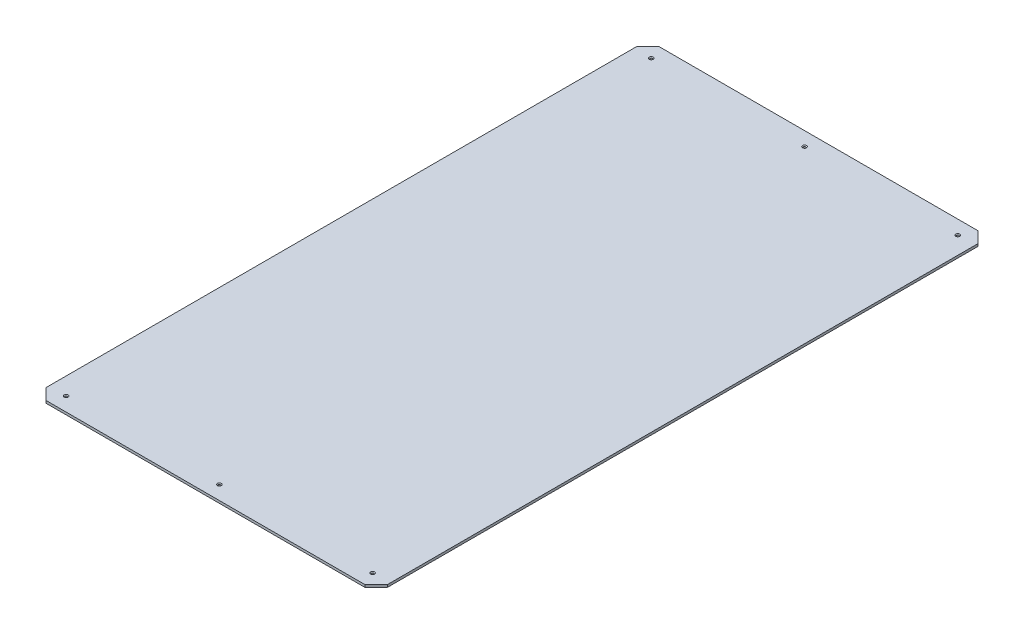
ISO-10303-21;
HEADER;
FILE_DESCRIPTION(('STEP AP214'),'2;1');
FILE_NAME('part.step','',(''),(''),'','','');
FILE_SCHEMA(('AUTOMOTIVE_DESIGN { 1 0 10303 214 1 1 1 1 }'));
ENDSEC;
DATA;
#1=APPLICATION_CONTEXT('core data for automotive mechanical design processes');
#2=APPLICATION_PROTOCOL_DEFINITION('international standard','automotive_design',2000,#1);
#3=PRODUCT_CONTEXT('',#1,'mechanical');
#4=PRODUCT('Part','Part','',(#3));
#5=PRODUCT_RELATED_PRODUCT_CATEGORY('part','',(#4));
#6=PRODUCT_DEFINITION_FORMATION('','',#4);
#7=PRODUCT_DEFINITION_CONTEXT('part definition',#1,'design');
#8=PRODUCT_DEFINITION('design','',#6,#7);
#9=PRODUCT_DEFINITION_SHAPE('','',#8);
#10=(LENGTH_UNIT() NAMED_UNIT(*) SI_UNIT(.MILLI.,.METRE.));
#11=(NAMED_UNIT(*) PLANE_ANGLE_UNIT() SI_UNIT($,.RADIAN.));
#12=(NAMED_UNIT(*) SI_UNIT($,.STERADIAN.) SOLID_ANGLE_UNIT());
#13=UNCERTAINTY_MEASURE_WITH_UNIT(LENGTH_MEASURE(1.E-05),#10,'distance_accuracy_value','');
#14=(GEOMETRIC_REPRESENTATION_CONTEXT(3) GLOBAL_UNCERTAINTY_ASSIGNED_CONTEXT((#13)) GLOBAL_UNIT_ASSIGNED_CONTEXT((#10,
#11,#12)) REPRESENTATION_CONTEXT('',''));
#15=CARTESIAN_POINT('',(0.,0.,0.));
#16=DIRECTION('',(0.,0.,1.));
#17=DIRECTION('',(1.,0.,0.));
#18=AXIS2_PLACEMENT_3D('',#15,#16,#17);
#19=CARTESIAN_POINT('',(-245.,-3.5,440.));
#20=DIRECTION('',(-1.,0.,0.));
#21=DIRECTION('',(0.,0.,1.));
#22=AXIS2_PLACEMENT_3D('',#19,#20,#21);
#23=PLANE('',#22);
#24=DIRECTION('',(0.,0.,1.));
#25=VECTOR('',#24,1.);
#26=CARTESIAN_POINT('',(-245.,0.,440.));
#27=LINE('',#26,#25);
#28=CARTESIAN_POINT('',(-245.,0.,-424.));
#29=VERTEX_POINT('',#28);
#30=CARTESIAN_POINT('',(-245.,0.,424.));
#31=VERTEX_POINT('',#30);
#32=EDGE_CURVE('E97',#29,#31,#27,.T.);
#33=ORIENTED_EDGE('',*,*,#32,.F.);
#34=DIRECTION('',(0.,-1.,0.));
#35=VECTOR('',#34,1.);
#36=CARTESIAN_POINT('',(-245.,-3.5,-424.));
#37=LINE('',#36,#35);
#38=CARTESIAN_POINT('',(-245.,-3.5,-424.));
#39=VERTEX_POINT('',#38);
#40=EDGE_CURVE('E146',#29,#39,#37,.T.);
#41=ORIENTED_EDGE('',*,*,#40,.T.);
#42=DIRECTION('',(0.,0.,1.));
#43=VECTOR('',#42,1.);
#44=CARTESIAN_POINT('',(-245.,-3.5,440.));
#45=LINE('',#44,#43);
#46=CARTESIAN_POINT('',(-245.,-3.5,424.));
#47=VERTEX_POINT('',#46);
#48=EDGE_CURVE('E120',#39,#47,#45,.T.);
#49=ORIENTED_EDGE('',*,*,#48,.T.);
#50=DIRECTION('',(0.,1.,0.));
#51=VECTOR('',#50,1.);
#52=CARTESIAN_POINT('',(-245.,-3.5,424.));
#53=LINE('',#52,#51);
#54=EDGE_CURVE('E116',#47,#31,#53,.T.);
#55=ORIENTED_EDGE('',*,*,#54,.T.);
#56=EDGE_LOOP('',(#33,#41,#49,#55));
#57=FACE_BOUND('',#56,.T.);
#58=ADVANCED_FACE('F36',(#57),#23,.T.);
#59=CARTESIAN_POINT('',(245.,-3.5,-440.));
#60=DIRECTION('',(0.,0.,-1.));
#61=DIRECTION('',(-1.,0.,0.));
#62=AXIS2_PLACEMENT_3D('',#59,#60,#61);
#63=PLANE('',#62);
#64=DIRECTION('',(-1.,0.,0.));
#65=VECTOR('',#64,1.);
#66=CARTESIAN_POINT('',(245.,0.,-440.));
#67=LINE('',#66,#65);
#68=CARTESIAN_POINT('',(229.,0.,-440.));
#69=VERTEX_POINT('',#68);
#70=CARTESIAN_POINT('',(-229.,0.,-440.));
#71=VERTEX_POINT('',#70);
#72=EDGE_CURVE('E127',#69,#71,#67,.T.);
#73=ORIENTED_EDGE('',*,*,#72,.F.);
#74=DIRECTION('',(0.,-1.,0.));
#75=VECTOR('',#74,1.);
#76=CARTESIAN_POINT('',(229.,-3.5,-440.));
#77=LINE('',#76,#75);
#78=CARTESIAN_POINT('',(229.,-3.5,-440.));
#79=VERTEX_POINT('',#78);
#80=EDGE_CURVE('E44',#69,#79,#77,.T.);
#81=ORIENTED_EDGE('',*,*,#80,.T.);
#82=DIRECTION('',(-1.,0.,0.));
#83=VECTOR('',#82,1.);
#84=CARTESIAN_POINT('',(245.,-3.5,-440.));
#85=LINE('',#84,#83);
#86=CARTESIAN_POINT('',(-229.,-3.5,-440.));
#87=VERTEX_POINT('',#86);
#88=EDGE_CURVE('E122',#79,#87,#85,.T.);
#89=ORIENTED_EDGE('',*,*,#88,.T.);
#90=DIRECTION('',(0.,1.,0.));
#91=VECTOR('',#90,1.);
#92=CARTESIAN_POINT('',(-229.,-3.5,-440.));
#93=LINE('',#92,#91);
#94=EDGE_CURVE('E142',#87,#71,#93,.T.);
#95=ORIENTED_EDGE('',*,*,#94,.T.);
#96=EDGE_LOOP('',(#73,#81,#89,#95));
#97=FACE_BOUND('',#96,.T.);
#98=ADVANCED_FACE('F258',(#97),#63,.T.);
#99=CARTESIAN_POINT('',(245.,-3.5,440.));
#100=DIRECTION('',(1.,0.,0.));
#101=DIRECTION('',(0.,0.,-1.));
#102=AXIS2_PLACEMENT_3D('',#99,#100,#101);
#103=PLANE('',#102);
#104=DIRECTION('',(0.,0.,-1.));
#105=VECTOR('',#104,1.);
#106=CARTESIAN_POINT('',(245.,-3.5,440.));
#107=LINE('',#106,#105);
#108=CARTESIAN_POINT('',(245.,-3.5,424.));
#109=VERTEX_POINT('',#108);
#110=CARTESIAN_POINT('',(245.,-3.5,-424.));
#111=VERTEX_POINT('',#110);
#112=EDGE_CURVE('E124',#109,#111,#107,.T.);
#113=ORIENTED_EDGE('',*,*,#112,.T.);
#114=DIRECTION('',(0.,1.,0.));
#115=VECTOR('',#114,1.);
#116=CARTESIAN_POINT('',(245.,-3.5,-424.));
#117=LINE('',#116,#115);
#118=CARTESIAN_POINT('',(245.,0.,-424.));
#119=VERTEX_POINT('',#118);
#120=EDGE_CURVE('E151',#111,#119,#117,.T.);
#121=ORIENTED_EDGE('',*,*,#120,.T.);
#122=DIRECTION('',(0.,0.,-1.));
#123=VECTOR('',#122,1.);
#124=CARTESIAN_POINT('',(245.,0.,440.));
#125=LINE('',#124,#123);
#126=CARTESIAN_POINT('',(245.,0.,424.));
#127=VERTEX_POINT('',#126);
#128=EDGE_CURVE('E159',#127,#119,#125,.T.);
#129=ORIENTED_EDGE('',*,*,#128,.F.);
#130=DIRECTION('',(0.,-1.,0.));
#131=VECTOR('',#130,1.);
#132=CARTESIAN_POINT('',(245.,-3.5,424.));
#133=LINE('',#132,#131);
#134=EDGE_CURVE('E138',#127,#109,#133,.T.);
#135=ORIENTED_EDGE('',*,*,#134,.T.);
#136=EDGE_LOOP('',(#113,#121,#129,#135));
#137=FACE_BOUND('',#136,.T.);
#138=ADVANCED_FACE('F158',(#137),#103,.T.);
#139=CARTESIAN_POINT('',(245.,-3.5,440.));
#140=DIRECTION('',(0.,0.,1.));
#141=DIRECTION('',(1.,0.,0.));
#142=AXIS2_PLACEMENT_3D('',#139,#140,#141);
#143=PLANE('',#142);
#144=DIRECTION('',(1.,0.,0.));
#145=VECTOR('',#144,1.);
#146=CARTESIAN_POINT('',(245.,-3.5,440.));
#147=LINE('',#146,#145);
#148=CARTESIAN_POINT('',(-229.,-3.5,440.));
#149=VERTEX_POINT('',#148);
#150=CARTESIAN_POINT('',(229.,-3.5,440.));
#151=VERTEX_POINT('',#150);
#152=EDGE_CURVE('E167',#149,#151,#147,.T.);
#153=ORIENTED_EDGE('',*,*,#152,.T.);
#154=DIRECTION('',(0.,1.,0.));
#155=VECTOR('',#154,1.);
#156=CARTESIAN_POINT('',(229.,-3.5,440.));
#157=LINE('',#156,#155);
#158=CARTESIAN_POINT('',(229.,0.,440.));
#159=VERTEX_POINT('',#158);
#160=EDGE_CURVE('E133',#151,#159,#157,.T.);
#161=ORIENTED_EDGE('',*,*,#160,.T.);
#162=DIRECTION('',(1.,0.,0.));
#163=VECTOR('',#162,1.);
#164=CARTESIAN_POINT('',(245.,0.,440.));
#165=LINE('',#164,#163);
#166=CARTESIAN_POINT('',(-229.,0.,440.));
#167=VERTEX_POINT('',#166);
#168=EDGE_CURVE('E108',#167,#159,#165,.T.);
#169=ORIENTED_EDGE('',*,*,#168,.F.);
#170=DIRECTION('',(0.,-1.,0.));
#171=VECTOR('',#170,1.);
#172=CARTESIAN_POINT('',(-229.,-3.5,440.));
#173=LINE('',#172,#171);
#174=EDGE_CURVE('E117',#167,#149,#173,.T.);
#175=ORIENTED_EDGE('',*,*,#174,.T.);
#176=EDGE_LOOP('',(#153,#161,#169,#175));
#177=FACE_BOUND('',#176,.T.);
#178=ADVANCED_FACE('F266',(#177),#143,.T.);
#179=CARTESIAN_POINT('',(-245.,-3.5,-440.));
#180=DIRECTION('',(0.,1.,0.));
#181=DIRECTION('',(0.,0.,1.));
#182=AXIS2_PLACEMENT_3D('',#179,#180,#181);
#183=PLANE('',#182);
#184=CARTESIAN_POINT('',(-220.,-3.5,-420.));
#185=DIRECTION('',(0.,1.,0.));
#186=DIRECTION('',(0.,0.,1.));
#187=AXIS2_PLACEMENT_3D('',#184,#185,#186);
#188=CIRCLE('',#187,1.63194999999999);
#189=CARTESIAN_POINT('',(-220.,-3.5,-418.36805));
#190=VERTEX_POINT('',#189);
#191=EDGE_CURVE('E215',#190,#190,#188,.T.);
#192=ORIENTED_EDGE('',*,*,#191,.T.);
#193=EDGE_LOOP('',(#192));
#194=FACE_BOUND('',#193,.T.);
#195=CARTESIAN_POINT('',(0.,-3.5,-420.));
#196=DIRECTION('',(0.,1.,0.));
#197=DIRECTION('',(0.,0.,1.));
#198=AXIS2_PLACEMENT_3D('',#195,#196,#197);
#199=CIRCLE('',#198,1.63195);
#200=CARTESIAN_POINT('',(0.,-3.5,-418.36805));
#201=VERTEX_POINT('',#200);
#202=EDGE_CURVE('E206',#201,#201,#199,.T.);
#203=ORIENTED_EDGE('',*,*,#202,.T.);
#204=EDGE_LOOP('',(#203));
#205=FACE_BOUND('',#204,.T.);
#206=CARTESIAN_POINT('',(220.,-3.5,-420.));
#207=DIRECTION('',(0.,1.,0.));
#208=DIRECTION('',(0.,0.,1.));
#209=AXIS2_PLACEMENT_3D('',#206,#207,#208);
#210=CIRCLE('',#209,1.63194999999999);
#211=CARTESIAN_POINT('',(220.,-3.5,-418.36805));
#212=VERTEX_POINT('',#211);
#213=EDGE_CURVE('E197',#212,#212,#210,.T.);
#214=ORIENTED_EDGE('',*,*,#213,.T.);
#215=EDGE_LOOP('',(#214));
#216=FACE_BOUND('',#215,.T.);
#217=CARTESIAN_POINT('',(-220.,-3.5,420.));
#218=DIRECTION('',(0.,1.,0.));
#219=DIRECTION('',(0.,0.,1.));
#220=AXIS2_PLACEMENT_3D('',#217,#218,#219);
#221=CIRCLE('',#220,1.63194999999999);
#222=CARTESIAN_POINT('',(-220.,-3.5,421.63195));
#223=VERTEX_POINT('',#222);
#224=EDGE_CURVE('E188',#223,#223,#221,.T.);
#225=ORIENTED_EDGE('',*,*,#224,.T.);
#226=EDGE_LOOP('',(#225));
#227=FACE_BOUND('',#226,.T.);
#228=CARTESIAN_POINT('',(0.,-3.5,420.));
#229=DIRECTION('',(0.,1.,0.));
#230=DIRECTION('',(0.,0.,1.));
#231=AXIS2_PLACEMENT_3D('',#228,#229,#230);
#232=CIRCLE('',#231,1.63195);
#233=CARTESIAN_POINT('',(0.,-3.5,421.63195));
#234=VERTEX_POINT('',#233);
#235=EDGE_CURVE('E179',#234,#234,#232,.T.);
#236=ORIENTED_EDGE('',*,*,#235,.T.);
#237=EDGE_LOOP('',(#236));
#238=FACE_BOUND('',#237,.T.);
#239=CARTESIAN_POINT('',(220.,-3.5,420.));
#240=DIRECTION('',(0.,1.,0.));
#241=DIRECTION('',(0.,0.,1.));
#242=AXIS2_PLACEMENT_3D('',#239,#240,#241);
#243=CIRCLE('',#242,1.63194999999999);
#244=CARTESIAN_POINT('',(220.,-3.5,421.63195));
#245=VERTEX_POINT('',#244);
#246=EDGE_CURVE('E109',#245,#245,#243,.T.);
#247=ORIENTED_EDGE('',*,*,#246,.T.);
#248=EDGE_LOOP('',(#247));
#249=FACE_BOUND('',#248,.T.);
#250=ORIENTED_EDGE('',*,*,#88,.F.);
#251=DIRECTION('',(-0.707106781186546,0.,-0.707106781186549));
#252=VECTOR('',#251,1.);
#253=CARTESIAN_POINT('',(245.,-3.5,-424.));
#254=LINE('',#253,#252);
#255=EDGE_CURVE('E11',#79,#111,#254,.F.);
#256=ORIENTED_EDGE('',*,*,#255,.T.);
#257=ORIENTED_EDGE('',*,*,#112,.F.);
#258=DIRECTION('',(0.707106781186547,0.,-0.707106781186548));
#259=VECTOR('',#258,1.);
#260=CARTESIAN_POINT('',(229.,-3.5,440.));
#261=LINE('',#260,#259);
#262=EDGE_CURVE('E140',#109,#151,#261,.F.);
#263=ORIENTED_EDGE('',*,*,#262,.T.);
#264=ORIENTED_EDGE('',*,*,#152,.F.);
#265=DIRECTION('',(0.707106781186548,0.,0.707106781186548));
#266=VECTOR('',#265,1.);
#267=CARTESIAN_POINT('',(-245.,-3.5,424.));
#268=LINE('',#267,#266);
#269=EDGE_CURVE('E131',#149,#47,#268,.F.);
#270=ORIENTED_EDGE('',*,*,#269,.T.);
#271=ORIENTED_EDGE('',*,*,#48,.F.);
#272=DIRECTION('',(-0.70710678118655,0.,0.707106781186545));
#273=VECTOR('',#272,1.);
#274=CARTESIAN_POINT('',(-229.,-3.5,-440.));
#275=LINE('',#274,#273);
#276=EDGE_CURVE('E148',#39,#87,#275,.F.);
#277=ORIENTED_EDGE('',*,*,#276,.T.);
#278=EDGE_LOOP('',(#250,#256,#257,#263,#264,#270,#271,#277));
#279=FACE_BOUND('',#278,.T.);
#280=ADVANCED_FACE('F229',(#194,#205,#216,#227,#238,#249,#279),#183,.F.);
#281=CARTESIAN_POINT('',(-245.,0.,-440.));
#282=DIRECTION('',(0.,1.,0.));
#283=DIRECTION('',(0.,0.,1.));
#284=AXIS2_PLACEMENT_3D('',#281,#282,#283);
#285=PLANE('',#284);
#286=CARTESIAN_POINT('',(-220.,0.,-420.));
#287=DIRECTION('',(0.,1.,0.));
#288=DIRECTION('',(0.,0.,1.));
#289=AXIS2_PLACEMENT_3D('',#286,#287,#288);
#290=CIRCLE('',#289,2.85750000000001);
#291=CARTESIAN_POINT('',(-220.,0.,-417.1425));
#292=VERTEX_POINT('',#291);
#293=EDGE_CURVE('E221',#292,#292,#290,.T.);
#294=ORIENTED_EDGE('',*,*,#293,.F.);
#295=EDGE_LOOP('',(#294));
#296=FACE_BOUND('',#295,.T.);
#297=CARTESIAN_POINT('',(0.,0.,-420.));
#298=DIRECTION('',(0.,1.,0.));
#299=DIRECTION('',(0.,0.,1.));
#300=AXIS2_PLACEMENT_3D('',#297,#298,#299);
#301=CIRCLE('',#300,2.8575);
#302=CARTESIAN_POINT('',(0.,0.,-417.1425));
#303=VERTEX_POINT('',#302);
#304=EDGE_CURVE('E212',#303,#303,#301,.T.);
#305=ORIENTED_EDGE('',*,*,#304,.F.);
#306=EDGE_LOOP('',(#305));
#307=FACE_BOUND('',#306,.T.);
#308=CARTESIAN_POINT('',(220.,0.,-420.));
#309=DIRECTION('',(0.,1.,0.));
#310=DIRECTION('',(0.,0.,1.));
#311=AXIS2_PLACEMENT_3D('',#308,#309,#310);
#312=CIRCLE('',#311,2.85750000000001);
#313=CARTESIAN_POINT('',(220.,0.,-417.1425));
#314=VERTEX_POINT('',#313);
#315=EDGE_CURVE('E203',#314,#314,#312,.T.);
#316=ORIENTED_EDGE('',*,*,#315,.F.);
#317=EDGE_LOOP('',(#316));
#318=FACE_BOUND('',#317,.T.);
#319=CARTESIAN_POINT('',(-220.,0.,420.));
#320=DIRECTION('',(0.,1.,0.));
#321=DIRECTION('',(0.,0.,1.));
#322=AXIS2_PLACEMENT_3D('',#319,#320,#321);
#323=CIRCLE('',#322,2.85750000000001);
#324=CARTESIAN_POINT('',(-220.,0.,422.8575));
#325=VERTEX_POINT('',#324);
#326=EDGE_CURVE('E194',#325,#325,#323,.T.);
#327=ORIENTED_EDGE('',*,*,#326,.F.);
#328=EDGE_LOOP('',(#327));
#329=FACE_BOUND('',#328,.T.);
#330=CARTESIAN_POINT('',(0.,0.,420.));
#331=DIRECTION('',(0.,1.,0.));
#332=DIRECTION('',(0.,0.,1.));
#333=AXIS2_PLACEMENT_3D('',#330,#331,#332);
#334=CIRCLE('',#333,2.8575);
#335=CARTESIAN_POINT('',(0.,0.,422.8575));
#336=VERTEX_POINT('',#335);
#337=EDGE_CURVE('E185',#336,#336,#334,.T.);
#338=ORIENTED_EDGE('',*,*,#337,.F.);
#339=EDGE_LOOP('',(#338));
#340=FACE_BOUND('',#339,.T.);
#341=CARTESIAN_POINT('',(220.,0.,420.));
#342=DIRECTION('',(0.,1.,0.));
#343=DIRECTION('',(0.,0.,1.));
#344=AXIS2_PLACEMENT_3D('',#341,#342,#343);
#345=CIRCLE('',#344,2.85750000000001);
#346=CARTESIAN_POINT('',(220.,0.,422.8575));
#347=VERTEX_POINT('',#346);
#348=EDGE_CURVE('E176',#347,#347,#345,.T.);
#349=ORIENTED_EDGE('',*,*,#348,.F.);
#350=EDGE_LOOP('',(#349));
#351=FACE_BOUND('',#350,.T.);
#352=ORIENTED_EDGE('',*,*,#128,.T.);
#353=DIRECTION('',(0.707106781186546,0.,0.707106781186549));
#354=VECTOR('',#353,1.);
#355=CARTESIAN_POINT('',(-7.99999999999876,0.,-677.));
#356=LINE('',#355,#354);
#357=EDGE_CURVE('E58',#119,#69,#356,.F.);
#358=ORIENTED_EDGE('',*,*,#357,.T.);
#359=ORIENTED_EDGE('',*,*,#72,.T.);
#360=DIRECTION('',(0.70710678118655,0.,-0.707106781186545));
#361=VECTOR('',#360,1.);
#362=CARTESIAN_POINT('',(-237.,0.,-432.));
#363=LINE('',#362,#361);
#364=EDGE_CURVE('E104',#71,#29,#363,.F.);
#365=ORIENTED_EDGE('',*,*,#364,.T.);
#366=ORIENTED_EDGE('',*,*,#32,.T.);
#367=DIRECTION('',(-0.707106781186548,0.,-0.707106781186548));
#368=VECTOR('',#367,1.);
#369=CARTESIAN_POINT('',(-677.,0.,-7.99999999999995));
#370=LINE('',#369,#368);
#371=EDGE_CURVE('E101',#31,#167,#370,.F.);
#372=ORIENTED_EDGE('',*,*,#371,.T.);
#373=ORIENTED_EDGE('',*,*,#168,.T.);
#374=DIRECTION('',(-0.707106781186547,0.,0.707106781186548));
#375=VECTOR('',#374,1.);
#376=CARTESIAN_POINT('',(432.,0.,236.999999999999));
#377=LINE('',#376,#375);
#378=EDGE_CURVE('E136',#159,#127,#377,.F.);
#379=ORIENTED_EDGE('',*,*,#378,.T.);
#380=EDGE_LOOP('',(#352,#358,#359,#365,#366,#372,#373,#379));
#381=FACE_BOUND('',#380,.T.);
#382=ADVANCED_FACE('F99',(#296,#307,#318,#329,#340,#351,#381),#285,.T.);
#383=CARTESIAN_POINT('',(-245.,-3.5,424.));
#384=DIRECTION('',(0.707106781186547,0.,-0.707106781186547));
#385=DIRECTION('',(-0.707106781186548,0.,-0.707106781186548));
#386=AXIS2_PLACEMENT_3D('',#383,#384,#385);
#387=PLANE('',#386);
#388=ORIENTED_EDGE('',*,*,#269,.F.);
#389=ORIENTED_EDGE('',*,*,#174,.F.);
#390=ORIENTED_EDGE('',*,*,#371,.F.);
#391=ORIENTED_EDGE('',*,*,#54,.F.);
#392=EDGE_LOOP('',(#388,#389,#390,#391));
#393=FACE_BOUND('',#392,.T.);
#394=ADVANCED_FACE('F115',(#393),#387,.F.);
#395=CARTESIAN_POINT('',(229.,-3.5,440.));
#396=DIRECTION('',(-0.707106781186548,0.,-0.707106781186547));
#397=DIRECTION('',(-0.707106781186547,0.,0.707106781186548));
#398=AXIS2_PLACEMENT_3D('',#395,#396,#397);
#399=PLANE('',#398);
#400=ORIENTED_EDGE('',*,*,#262,.F.);
#401=ORIENTED_EDGE('',*,*,#134,.F.);
#402=ORIENTED_EDGE('',*,*,#378,.F.);
#403=ORIENTED_EDGE('',*,*,#160,.F.);
#404=EDGE_LOOP('',(#400,#401,#402,#403));
#405=FACE_BOUND('',#404,.T.);
#406=ADVANCED_FACE('F270',(#405),#399,.F.);
#407=CARTESIAN_POINT('',(-229.,-3.5,-440.));
#408=DIRECTION('',(0.707106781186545,0.,0.70710678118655));
#409=DIRECTION('',(0.70710678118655,0.,-0.707106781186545));
#410=AXIS2_PLACEMENT_3D('',#407,#408,#409);
#411=PLANE('',#410);
#412=ORIENTED_EDGE('',*,*,#276,.F.);
#413=ORIENTED_EDGE('',*,*,#40,.F.);
#414=ORIENTED_EDGE('',*,*,#364,.F.);
#415=ORIENTED_EDGE('',*,*,#94,.F.);
#416=EDGE_LOOP('',(#412,#413,#414,#415));
#417=FACE_BOUND('',#416,.T.);
#418=ADVANCED_FACE('F272',(#417),#411,.F.);
#419=CARTESIAN_POINT('',(245.,-3.5,-424.));
#420=DIRECTION('',(-0.707106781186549,0.,0.707106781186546));
#421=DIRECTION('',(0.707106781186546,0.,0.707106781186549));
#422=AXIS2_PLACEMENT_3D('',#419,#420,#421);
#423=PLANE('',#422);
#424=ORIENTED_EDGE('',*,*,#255,.F.);
#425=ORIENTED_EDGE('',*,*,#80,.F.);
#426=ORIENTED_EDGE('',*,*,#357,.F.);
#427=ORIENTED_EDGE('',*,*,#120,.F.);
#428=EDGE_LOOP('',(#424,#425,#426,#427));
#429=FACE_BOUND('',#428,.T.);
#430=ADVANCED_FACE('F38',(#429),#423,.F.);
#431=CARTESIAN_POINT('',(220.,0.,420.));
#432=DIRECTION('',(0.,1.,0.));
#433=DIRECTION('',(0.,0.,1.));
#434=AXIS2_PLACEMENT_3D('',#431,#432,#433);
#435=CYLINDRICAL_SURFACE('',#434,1.63194999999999);
#436=ORIENTED_EDGE('',*,*,#246,.F.);
#437=EDGE_LOOP('',(#436));
#438=FACE_BOUND('',#437,.T.);
#439=CARTESIAN_POINT('',(220.,-1.02835855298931,420.));
#440=DIRECTION('',(0.,1.,0.));
#441=DIRECTION('',(0.,0.,1.));
#442=AXIS2_PLACEMENT_3D('',#439,#440,#441);
#443=CIRCLE('',#442,1.63194999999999);
#444=CARTESIAN_POINT('',(220.,-1.02835855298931,421.63195));
#445=VERTEX_POINT('',#444);
#446=EDGE_CURVE('E173',#445,#445,#443,.T.);
#447=ORIENTED_EDGE('',*,*,#446,.T.);
#448=EDGE_LOOP('',(#447));
#449=FACE_BOUND('',#448,.T.);
#450=ADVANCED_FACE('F244',(#438,#449),#435,.F.);
#451=CARTESIAN_POINT('',(220.,0.,420.));
#452=DIRECTION('',(0.,1.,0.));
#453=DIRECTION('',(0.,0.,1.));
#454=AXIS2_PLACEMENT_3D('',#451,#452,#453);
#455=CONICAL_SURFACE('',#454,2.85750000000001,0.872664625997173);
#456=ORIENTED_EDGE('',*,*,#446,.F.);
#457=EDGE_LOOP('',(#456));
#458=FACE_BOUND('',#457,.T.);
#459=ORIENTED_EDGE('',*,*,#348,.T.);
#460=EDGE_LOOP('',(#459));
#461=FACE_BOUND('',#460,.T.);
#462=ADVANCED_FACE('F241',(#458,#461),#455,.F.);
#463=CARTESIAN_POINT('',(0.,0.,420.));
#464=DIRECTION('',(0.,1.,0.));
#465=DIRECTION('',(0.,0.,1.));
#466=AXIS2_PLACEMENT_3D('',#463,#464,#465);
#467=CYLINDRICAL_SURFACE('',#466,1.63195);
#468=ORIENTED_EDGE('',*,*,#235,.F.);
#469=EDGE_LOOP('',(#468));
#470=FACE_BOUND('',#469,.T.);
#471=CARTESIAN_POINT('',(0.,-1.02835855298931,420.));
#472=DIRECTION('',(0.,1.,0.));
#473=DIRECTION('',(0.,0.,1.));
#474=AXIS2_PLACEMENT_3D('',#471,#472,#473);
#475=CIRCLE('',#474,1.63195);
#476=CARTESIAN_POINT('',(0.,-1.02835855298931,421.63195));
#477=VERTEX_POINT('',#476);
#478=EDGE_CURVE('E182',#477,#477,#475,.T.);
#479=ORIENTED_EDGE('',*,*,#478,.T.);
#480=EDGE_LOOP('',(#479));
#481=FACE_BOUND('',#480,.T.);
#482=ADVANCED_FACE('F243',(#470,#481),#467,.F.);
#483=CARTESIAN_POINT('',(0.,0.,420.));
#484=DIRECTION('',(0.,1.,0.));
#485=DIRECTION('',(0.,0.,1.));
#486=AXIS2_PLACEMENT_3D('',#483,#484,#485);
#487=CONICAL_SURFACE('',#486,2.8575,0.872664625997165);
#488=ORIENTED_EDGE('',*,*,#478,.F.);
#489=EDGE_LOOP('',(#488));
#490=FACE_BOUND('',#489,.T.);
#491=ORIENTED_EDGE('',*,*,#337,.T.);
#492=EDGE_LOOP('',(#491));
#493=FACE_BOUND('',#492,.T.);
#494=ADVANCED_FACE('F251',(#490,#493),#487,.F.);
#495=CARTESIAN_POINT('',(-220.,0.,420.));
#496=DIRECTION('',(0.,1.,0.));
#497=DIRECTION('',(0.,0.,1.));
#498=AXIS2_PLACEMENT_3D('',#495,#496,#497);
#499=CYLINDRICAL_SURFACE('',#498,1.63194999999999);
#500=ORIENTED_EDGE('',*,*,#224,.F.);
#501=EDGE_LOOP('',(#500));
#502=FACE_BOUND('',#501,.T.);
#503=CARTESIAN_POINT('',(-220.,-1.02835855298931,420.));
#504=DIRECTION('',(0.,1.,0.));
#505=DIRECTION('',(0.,0.,1.));
#506=AXIS2_PLACEMENT_3D('',#503,#504,#505);
#507=CIRCLE('',#506,1.63194999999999);
#508=CARTESIAN_POINT('',(-220.,-1.02835855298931,421.63195));
#509=VERTEX_POINT('',#508);
#510=EDGE_CURVE('E191',#509,#509,#507,.T.);
#511=ORIENTED_EDGE('',*,*,#510,.T.);
#512=EDGE_LOOP('',(#511));
#513=FACE_BOUND('',#512,.T.);
#514=ADVANCED_FACE('F376',(#502,#513),#499,.F.);
#515=CARTESIAN_POINT('',(-220.,0.,420.));
#516=DIRECTION('',(0.,1.,0.));
#517=DIRECTION('',(0.,0.,1.));
#518=AXIS2_PLACEMENT_3D('',#515,#516,#517);
#519=CONICAL_SURFACE('',#518,2.85750000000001,0.872664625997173);
#520=ORIENTED_EDGE('',*,*,#510,.F.);
#521=EDGE_LOOP('',(#520));
#522=FACE_BOUND('',#521,.T.);
#523=ORIENTED_EDGE('',*,*,#326,.T.);
#524=EDGE_LOOP('',(#523));
#525=FACE_BOUND('',#524,.T.);
#526=ADVANCED_FACE('F385',(#522,#525),#519,.F.);
#527=CARTESIAN_POINT('',(220.,0.,-420.));
#528=DIRECTION('',(0.,1.,0.));
#529=DIRECTION('',(0.,0.,1.));
#530=AXIS2_PLACEMENT_3D('',#527,#528,#529);
#531=CYLINDRICAL_SURFACE('',#530,1.63194999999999);
#532=ORIENTED_EDGE('',*,*,#213,.F.);
#533=EDGE_LOOP('',(#532));
#534=FACE_BOUND('',#533,.T.);
#535=CARTESIAN_POINT('',(220.,-1.02835855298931,-420.));
#536=DIRECTION('',(0.,1.,0.));
#537=DIRECTION('',(0.,0.,1.));
#538=AXIS2_PLACEMENT_3D('',#535,#536,#537);
#539=CIRCLE('',#538,1.63194999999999);
#540=CARTESIAN_POINT('',(220.,-1.02835855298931,-418.36805));
#541=VERTEX_POINT('',#540);
#542=EDGE_CURVE('E200',#541,#541,#539,.T.);
#543=ORIENTED_EDGE('',*,*,#542,.T.);
#544=EDGE_LOOP('',(#543));
#545=FACE_BOUND('',#544,.T.);
#546=ADVANCED_FACE('F394',(#534,#545),#531,.F.);
#547=CARTESIAN_POINT('',(220.,0.,-420.));
#548=DIRECTION('',(0.,1.,0.));
#549=DIRECTION('',(0.,0.,1.));
#550=AXIS2_PLACEMENT_3D('',#547,#548,#549);
#551=CONICAL_SURFACE('',#550,2.85750000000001,0.872664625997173);
#552=ORIENTED_EDGE('',*,*,#542,.F.);
#553=EDGE_LOOP('',(#552));
#554=FACE_BOUND('',#553,.T.);
#555=ORIENTED_EDGE('',*,*,#315,.T.);
#556=EDGE_LOOP('',(#555));
#557=FACE_BOUND('',#556,.T.);
#558=ADVANCED_FACE('F403',(#554,#557),#551,.F.);
#559=CARTESIAN_POINT('',(0.,0.,-420.));
#560=DIRECTION('',(0.,1.,0.));
#561=DIRECTION('',(0.,0.,1.));
#562=AXIS2_PLACEMENT_3D('',#559,#560,#561);
#563=CYLINDRICAL_SURFACE('',#562,1.63195);
#564=ORIENTED_EDGE('',*,*,#202,.F.);
#565=EDGE_LOOP('',(#564));
#566=FACE_BOUND('',#565,.T.);
#567=CARTESIAN_POINT('',(0.,-1.02835855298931,-420.));
#568=DIRECTION('',(0.,1.,0.));
#569=DIRECTION('',(0.,0.,1.));
#570=AXIS2_PLACEMENT_3D('',#567,#568,#569);
#571=CIRCLE('',#570,1.63195);
#572=CARTESIAN_POINT('',(0.,-1.02835855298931,-418.36805));
#573=VERTEX_POINT('',#572);
#574=EDGE_CURVE('E209',#573,#573,#571,.T.);
#575=ORIENTED_EDGE('',*,*,#574,.T.);
#576=EDGE_LOOP('',(#575));
#577=FACE_BOUND('',#576,.T.);
#578=ADVANCED_FACE('F412',(#566,#577),#563,.F.);
#579=CARTESIAN_POINT('',(0.,0.,-420.));
#580=DIRECTION('',(0.,1.,0.));
#581=DIRECTION('',(0.,0.,1.));
#582=AXIS2_PLACEMENT_3D('',#579,#580,#581);
#583=CONICAL_SURFACE('',#582,2.8575,0.872664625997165);
#584=ORIENTED_EDGE('',*,*,#574,.F.);
#585=EDGE_LOOP('',(#584));
#586=FACE_BOUND('',#585,.T.);
#587=ORIENTED_EDGE('',*,*,#304,.T.);
#588=EDGE_LOOP('',(#587));
#589=FACE_BOUND('',#588,.T.);
#590=ADVANCED_FACE('F421',(#586,#589),#583,.F.);
#591=CARTESIAN_POINT('',(-220.,0.,-420.));
#592=DIRECTION('',(0.,1.,0.));
#593=DIRECTION('',(0.,0.,1.));
#594=AXIS2_PLACEMENT_3D('',#591,#592,#593);
#595=CYLINDRICAL_SURFACE('',#594,1.63194999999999);
#596=ORIENTED_EDGE('',*,*,#191,.F.);
#597=EDGE_LOOP('',(#596));
#598=FACE_BOUND('',#597,.T.);
#599=CARTESIAN_POINT('',(-220.,-1.02835855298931,-420.));
#600=DIRECTION('',(0.,1.,0.));
#601=DIRECTION('',(0.,0.,1.));
#602=AXIS2_PLACEMENT_3D('',#599,#600,#601);
#603=CIRCLE('',#602,1.63194999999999);
#604=CARTESIAN_POINT('',(-220.,-1.02835855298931,-418.36805));
#605=VERTEX_POINT('',#604);
#606=EDGE_CURVE('E218',#605,#605,#603,.T.);
#607=ORIENTED_EDGE('',*,*,#606,.T.);
#608=EDGE_LOOP('',(#607));
#609=FACE_BOUND('',#608,.T.);
#610=ADVANCED_FACE('F430',(#598,#609),#595,.F.);
#611=CARTESIAN_POINT('',(-220.,0.,-420.));
#612=DIRECTION('',(0.,1.,0.));
#613=DIRECTION('',(0.,0.,1.));
#614=AXIS2_PLACEMENT_3D('',#611,#612,#613);
#615=CONICAL_SURFACE('',#614,2.85750000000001,0.872664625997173);
#616=ORIENTED_EDGE('',*,*,#606,.F.);
#617=EDGE_LOOP('',(#616));
#618=FACE_BOUND('',#617,.T.);
#619=ORIENTED_EDGE('',*,*,#293,.T.);
#620=EDGE_LOOP('',(#619));
#621=FACE_BOUND('',#620,.T.);
#622=ADVANCED_FACE('F225',(#618,#621),#615,.F.);
#623=CLOSED_SHELL('',(#58,#98,#138,#178,#280,#382,#394,#406,#418,#430,#450,#462,#482,#494,#514,
#526,#546,#558,#578,#590,#610,#622));
#624=MANIFOLD_SOLID_BREP('B2',#623);
#625=ADVANCED_BREP_SHAPE_REPRESENTATION('',(#18,#624),#14);
#626=SHAPE_DEFINITION_REPRESENTATION(#9,#625);
ENDSEC;
END-ISO-10303-21;
